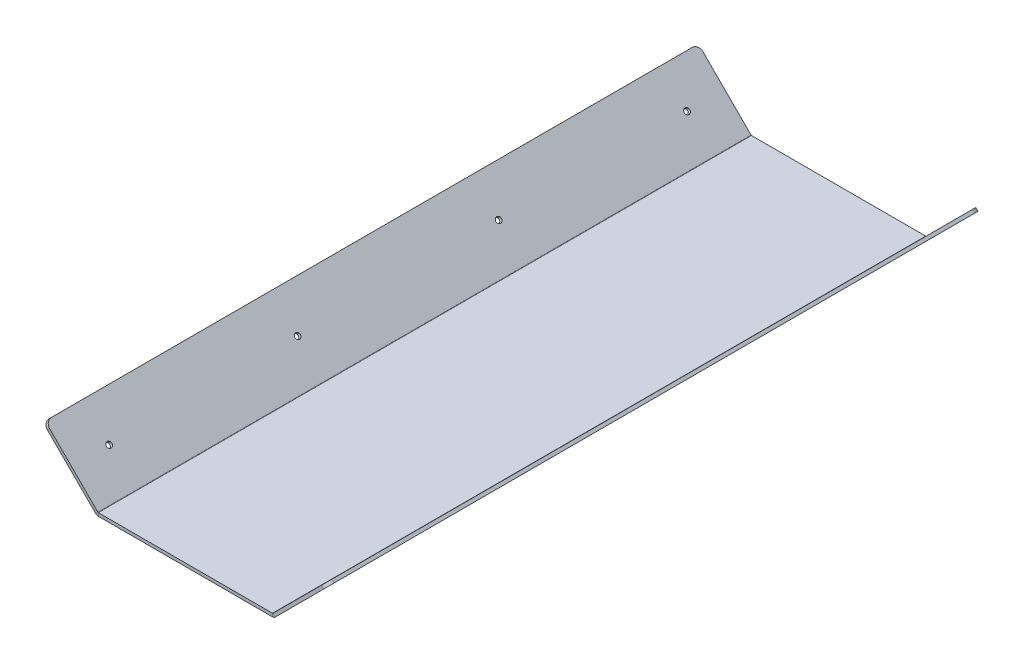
ISO-10303-21;
HEADER;
FILE_DESCRIPTION(('STEP AP214'),'2;1');
FILE_NAME('part.step','',(''),(''),'','','');
FILE_SCHEMA(('AUTOMOTIVE_DESIGN { 1 0 10303 214 1 1 1 1 }'));
ENDSEC;
DATA;
#1=APPLICATION_CONTEXT('core data for automotive mechanical design processes');
#2=APPLICATION_PROTOCOL_DEFINITION('international standard','automotive_design',2000,#1);
#3=PRODUCT_CONTEXT('',#1,'mechanical');
#4=PRODUCT('Part','Part','',(#3));
#5=PRODUCT_RELATED_PRODUCT_CATEGORY('part','',(#4));
#6=PRODUCT_DEFINITION_FORMATION('','',#4);
#7=PRODUCT_DEFINITION_CONTEXT('part definition',#1,'design');
#8=PRODUCT_DEFINITION('design','',#6,#7);
#9=PRODUCT_DEFINITION_SHAPE('','',#8);
#10=(LENGTH_UNIT() NAMED_UNIT(*) SI_UNIT(.MILLI.,.METRE.));
#11=(NAMED_UNIT(*) PLANE_ANGLE_UNIT() SI_UNIT($,.RADIAN.));
#12=(NAMED_UNIT(*) SI_UNIT($,.STERADIAN.) SOLID_ANGLE_UNIT());
#13=UNCERTAINTY_MEASURE_WITH_UNIT(LENGTH_MEASURE(1.E-05),#10,'distance_accuracy_value','');
#14=(GEOMETRIC_REPRESENTATION_CONTEXT(3) GLOBAL_UNCERTAINTY_ASSIGNED_CONTEXT((#13)) GLOBAL_UNIT_ASSIGNED_CONTEXT((#10,
#11,#12)) REPRESENTATION_CONTEXT('',''));
#15=CARTESIAN_POINT('',(0.,0.,0.));
#16=DIRECTION('',(0.,0.,1.));
#17=DIRECTION('',(1.,0.,0.));
#18=AXIS2_PLACEMENT_3D('',#15,#16,#17);
#19=CARTESIAN_POINT('',(-52.0764143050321,125.723585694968,0.));
#20=DIRECTION('',(0.,-1.,0.));
#21=DIRECTION('',(0.,0.,-1.));
#22=AXIS2_PLACEMENT_3D('',#19,#20,#21);
#23=PLANE('',#22);
#24=DIRECTION('',(-1.,0.,0.));
#25=VECTOR('',#24,1.);
#26=CARTESIAN_POINT('',(-52.0764143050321,125.723585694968,-660.4));
#27=LINE('',#26,#25);
#28=CARTESIAN_POINT('',(201.010913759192,125.723585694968,-660.4));
#29=VERTEX_POINT('',#28);
#30=CARTESIAN_POINT('',(25.0362576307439,125.723585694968,-660.4));
#31=VERTEX_POINT('',#30);
#32=EDGE_CURVE('E281',#29,#31,#27,.T.);
#33=ORIENTED_EDGE('',*,*,#32,.F.);
#34=DIRECTION('',(0.,0.,1.));
#35=VECTOR('',#34,1.);
#36=CARTESIAN_POINT('',(201.010913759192,125.723585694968,0.));
#37=LINE('',#36,#35);
#38=CARTESIAN_POINT('',(201.010913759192,125.723585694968,0.));
#39=VERTEX_POINT('',#38);
#40=EDGE_CURVE('E276',#29,#39,#37,.T.);
#41=ORIENTED_EDGE('',*,*,#40,.T.);
#42=DIRECTION('',(1.,0.,0.));
#43=VECTOR('',#42,1.);
#44=CARTESIAN_POINT('',(-52.0764143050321,125.723585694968,0.));
#45=LINE('',#44,#43);
#46=CARTESIAN_POINT('',(25.0362576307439,125.723585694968,0.));
#47=VERTEX_POINT('',#46);
#48=EDGE_CURVE('E237',#47,#39,#45,.T.);
#49=ORIENTED_EDGE('',*,*,#48,.F.);
#50=DIRECTION('',(0.,0.,-1.));
#51=VECTOR('',#50,1.);
#52=CARTESIAN_POINT('',(25.0362576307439,125.723585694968,0.));
#53=LINE('',#52,#51);
#54=EDGE_CURVE('E265',#47,#31,#53,.T.);
#55=ORIENTED_EDGE('',*,*,#54,.T.);
#56=EDGE_LOOP('',(#33,#41,#49,#55));
#57=FACE_BOUND('',#56,.T.);
#58=ADVANCED_FACE('F46',(#57),#23,.T.);
#59=CARTESIAN_POINT('',(-52.0764143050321,128.898585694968,0.));
#60=DIRECTION('',(0.,0.,-1.));
#61=DIRECTION('',(-1.,0.,0.));
#62=AXIS2_PLACEMENT_3D('',#59,#60,#61);
#63=PLANE('',#62);
#64=DIRECTION('',(0.,-1.,0.));
#65=VECTOR('',#64,1.);
#66=CARTESIAN_POINT('',(201.010913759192,128.898585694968,0.));
#67=LINE('',#66,#65);
#68=CARTESIAN_POINT('',(201.010913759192,128.898585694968,0.));
#69=VERTEX_POINT('',#68);
#70=EDGE_CURVE('E273',#69,#39,#67,.T.);
#71=ORIENTED_EDGE('',*,*,#70,.F.);
#72=DIRECTION('',(1.,0.,0.));
#73=VECTOR('',#72,1.);
#74=CARTESIAN_POINT('',(-52.0764143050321,128.898585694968,0.));
#75=LINE('',#74,#73);
#76=CARTESIAN_POINT('',(25.0362576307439,128.898585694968,0.));
#77=VERTEX_POINT('',#76);
#78=EDGE_CURVE('E283',#77,#69,#75,.T.);
#79=ORIENTED_EDGE('',*,*,#78,.F.);
#80=DIRECTION('',(0.,1.,0.));
#81=VECTOR('',#80,1.);
#82=CARTESIAN_POINT('',(25.0362576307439,128.898585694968,0.));
#83=LINE('',#82,#81);
#84=EDGE_CURVE('E268',#47,#77,#83,.T.);
#85=ORIENTED_EDGE('',*,*,#84,.F.);
#86=ORIENTED_EDGE('',*,*,#48,.T.);
#87=EDGE_LOOP('',(#71,#79,#85,#86));
#88=FACE_BOUND('',#87,.T.);
#89=ADVANCED_FACE('F373',(#88),#63,.F.);
#90=CARTESIAN_POINT('',(-52.0764143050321,128.898585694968,-660.4));
#91=DIRECTION('',(0.,0.,1.));
#92=DIRECTION('',(1.,0.,0.));
#93=AXIS2_PLACEMENT_3D('',#90,#91,#92);
#94=PLANE('',#93);
#95=DIRECTION('',(0.,1.,0.));
#96=VECTOR('',#95,1.);
#97=CARTESIAN_POINT('',(201.010913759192,128.898585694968,-660.4));
#98=LINE('',#97,#96);
#99=CARTESIAN_POINT('',(201.010913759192,128.898585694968,-660.4));
#100=VERTEX_POINT('',#99);
#101=EDGE_CURVE('E188',#29,#100,#98,.T.);
#102=ORIENTED_EDGE('',*,*,#101,.F.);
#103=ORIENTED_EDGE('',*,*,#32,.T.);
#104=DIRECTION('',(0.,-1.,0.));
#105=VECTOR('',#104,1.);
#106=CARTESIAN_POINT('',(25.0362576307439,128.898585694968,-660.4));
#107=LINE('',#106,#105);
#108=CARTESIAN_POINT('',(25.0362576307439,128.898585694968,-660.4));
#109=VERTEX_POINT('',#108);
#110=EDGE_CURVE('E261',#109,#31,#107,.T.);
#111=ORIENTED_EDGE('',*,*,#110,.F.);
#112=DIRECTION('',(-1.,0.,0.));
#113=VECTOR('',#112,1.);
#114=CARTESIAN_POINT('',(-52.0764143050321,128.898585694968,-660.4));
#115=LINE('',#114,#113);
#116=EDGE_CURVE('E262',#100,#109,#115,.T.);
#117=ORIENTED_EDGE('',*,*,#116,.F.);
#118=EDGE_LOOP('',(#102,#103,#111,#117));
#119=FACE_BOUND('',#118,.T.);
#120=ADVANCED_FACE('F380',(#119),#94,.F.);
#121=CARTESIAN_POINT('',(-52.0764143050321,128.898585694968,0.));
#122=DIRECTION('',(0.,-1.,0.));
#123=DIRECTION('',(0.,0.,-1.));
#124=AXIS2_PLACEMENT_3D('',#121,#122,#123);
#125=PLANE('',#124);
#126=DIRECTION('',(0.,0.,1.));
#127=VECTOR('',#126,1.);
#128=CARTESIAN_POINT('',(201.010913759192,128.898585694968,0.));
#129=LINE('',#128,#127);
#130=EDGE_CURVE('E271',#100,#69,#129,.T.);
#131=ORIENTED_EDGE('',*,*,#130,.F.);
#132=ORIENTED_EDGE('',*,*,#116,.T.);
#133=DIRECTION('',(0.,0.,-1.));
#134=VECTOR('',#133,1.);
#135=CARTESIAN_POINT('',(25.0362576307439,128.898585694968,0.));
#136=LINE('',#135,#134);
#137=EDGE_CURVE('E258',#77,#109,#136,.T.);
#138=ORIENTED_EDGE('',*,*,#137,.F.);
#139=ORIENTED_EDGE('',*,*,#78,.T.);
#140=EDGE_LOOP('',(#131,#132,#138,#139));
#141=FACE_BOUND('',#140,.T.);
#142=ADVANCED_FACE('F452',(#141),#125,.F.);
#143=CARTESIAN_POINT('',(-28.720777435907,182.350511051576,0.));
#144=DIRECTION('',(0.707106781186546,-0.707106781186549,0.));
#145=DIRECTION('',(0.,0.,-1.));
#146=AXIS2_PLACEMENT_3D('',#143,#144,#145);
#147=PLANE('',#146);
#148=DIRECTION('',(0.,0.,1.));
#149=VECTOR('',#148,1.);
#150=CARTESIAN_POINT('',(-28.720777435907,182.350511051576,0.));
#151=LINE('',#150,#149);
#152=CARTESIAN_POINT('',(-28.7207774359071,182.350511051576,-654.05));
#153=VERTEX_POINT('',#152);
#154=CARTESIAN_POINT('',(-28.720777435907,182.350511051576,-6.35));
#155=VERTEX_POINT('',#154);
#156=EDGE_CURVE('E245',#153,#155,#151,.T.);
#157=ORIENTED_EDGE('',*,*,#156,.F.);
#158=DIRECTION('',(-0.707106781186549,-0.707106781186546,0.));
#159=VECTOR('',#158,1.);
#160=CARTESIAN_POINT('',(-28.7207774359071,182.350511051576,-654.05));
#161=LINE('',#160,#159);
#162=CARTESIAN_POINT('',(-30.9658414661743,180.105447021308,-654.05));
#163=VERTEX_POINT('',#162);
#164=EDGE_CURVE('E332',#153,#163,#161,.T.);
#165=ORIENTED_EDGE('',*,*,#164,.T.);
#166=DIRECTION('',(0.,0.,1.));
#167=VECTOR('',#166,1.);
#168=CARTESIAN_POINT('',(-30.9658414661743,180.105447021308,0.));
#169=LINE('',#168,#167);
#170=CARTESIAN_POINT('',(-30.9658414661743,180.105447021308,-6.35));
#171=VERTEX_POINT('',#170);
#172=EDGE_CURVE('E254',#163,#171,#169,.T.);
#173=ORIENTED_EDGE('',*,*,#172,.T.);
#174=DIRECTION('',(-0.707106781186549,-0.707106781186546,0.));
#175=VECTOR('',#174,1.);
#176=CARTESIAN_POINT('',(-28.720777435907,182.350511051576,-6.35));
#177=LINE('',#176,#175);
#178=EDGE_CURVE('E330',#171,#155,#177,.F.);
#179=ORIENTED_EDGE('',*,*,#178,.T.);
#180=EDGE_LOOP('',(#157,#165,#173,#179));
#181=FACE_BOUND('',#180,.T.);
#182=ADVANCED_FACE('F346',(#181),#147,.F.);
#183=CARTESIAN_POINT('',(-28.720777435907,182.350511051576,0.));
#184=DIRECTION('',(-0.707106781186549,-0.707106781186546,0.));
#185=DIRECTION('',(0.,0.,-1.));
#186=AXIS2_PLACEMENT_3D('',#183,#184,#185);
#187=PLANE('',#186);
#188=CARTESIAN_POINT('',(-2.10268733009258,155.732420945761,-38.1));
#189=DIRECTION('',(0.707106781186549,0.707106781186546,0.));
#190=DIRECTION('',(-0.707106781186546,0.707106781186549,0.));
#191=AXIS2_PLACEMENT_3D('',#188,#189,#190);
#192=CIRCLE('',#191,2.77812500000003);
#193=CARTESIAN_POINT('',(-4.06711835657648,157.696851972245,-38.1));
#194=VERTEX_POINT('',#193);
#195=EDGE_CURVE('E292',#194,#194,#192,.T.);
#196=ORIENTED_EDGE('',*,*,#195,.F.);
#197=EDGE_LOOP('',(#196));
#198=FACE_BOUND('',#197,.T.);
#199=CARTESIAN_POINT('',(-2.10268733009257,155.732420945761,-228.6));
#200=DIRECTION('',(0.707106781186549,0.707106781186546,0.));
#201=DIRECTION('',(-0.707106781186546,0.707106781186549,0.));
#202=AXIS2_PLACEMENT_3D('',#199,#200,#201);
#203=CIRCLE('',#202,2.77812499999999);
#204=CARTESIAN_POINT('',(-4.06711835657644,157.696851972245,-228.6));
#205=VERTEX_POINT('',#204);
#206=EDGE_CURVE('E396',#205,#205,#203,.T.);
#207=ORIENTED_EDGE('',*,*,#206,.F.);
#208=EDGE_LOOP('',(#207));
#209=FACE_BOUND('',#208,.T.);
#210=CARTESIAN_POINT('',(-2.10268733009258,155.732420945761,-431.8));
#211=DIRECTION('',(0.707106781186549,0.707106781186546,0.));
#212=DIRECTION('',(-0.707106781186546,0.707106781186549,0.));
#213=AXIS2_PLACEMENT_3D('',#210,#211,#212);
#214=CIRCLE('',#213,2.77812500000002);
#215=CARTESIAN_POINT('',(-4.06711835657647,157.696851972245,-431.8));
#216=VERTEX_POINT('',#215);
#217=EDGE_CURVE('E393',#216,#216,#214,.T.);
#218=ORIENTED_EDGE('',*,*,#217,.F.);
#219=EDGE_LOOP('',(#218));
#220=FACE_BOUND('',#219,.T.);
#221=CARTESIAN_POINT('',(-2.10268733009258,155.732420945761,-622.3));
#222=DIRECTION('',(0.707106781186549,0.707106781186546,0.));
#223=DIRECTION('',(-0.707106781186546,0.707106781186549,0.));
#224=AXIS2_PLACEMENT_3D('',#221,#222,#223);
#225=CIRCLE('',#224,2.77812499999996);
#226=CARTESIAN_POINT('',(-4.06711835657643,157.696851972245,-622.3));
#227=VERTEX_POINT('',#226);
#228=EDGE_CURVE('E314',#227,#227,#225,.T.);
#229=ORIENTED_EDGE('',*,*,#228,.F.);
#230=EDGE_LOOP('',(#229));
#231=FACE_BOUND('',#230,.T.);
#232=DIRECTION('',(-0.707106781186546,0.707106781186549,0.));
#233=VECTOR('',#232,1.);
#234=CARTESIAN_POINT('',(-28.7207774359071,182.350511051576,-660.4));
#235=LINE('',#234,#233);
#236=CARTESIAN_POINT('',(24.5154027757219,129.114330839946,-660.4));
#237=VERTEX_POINT('',#236);
#238=CARTESIAN_POINT('',(-24.2306493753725,177.860382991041,-660.4));
#239=VERTEX_POINT('',#238);
#240=EDGE_CURVE('E247',#237,#239,#235,.T.);
#241=ORIENTED_EDGE('',*,*,#240,.T.);
#242=CARTESIAN_POINT('',(-24.2306493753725,177.860382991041,-654.05));
#243=DIRECTION('',(-0.707106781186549,-0.707106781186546,0.));
#244=DIRECTION('',(0.707106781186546,-0.707106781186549,0.));
#245=AXIS2_PLACEMENT_3D('',#242,#243,#244);
#246=CIRCLE('',#245,6.35);
#247=EDGE_CURVE('E54',#239,#153,#246,.F.);
#248=ORIENTED_EDGE('',*,*,#247,.T.);
#249=ORIENTED_EDGE('',*,*,#156,.T.);
#250=CARTESIAN_POINT('',(-24.2306493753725,177.860382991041,-6.35));
#251=DIRECTION('',(-0.707106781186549,-0.707106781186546,0.));
#252=DIRECTION('',(0.707106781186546,-0.707106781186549,0.));
#253=AXIS2_PLACEMENT_3D('',#250,#251,#252);
#254=CIRCLE('',#253,6.35);
#255=CARTESIAN_POINT('',(-24.2306493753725,177.860382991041,0.));
#256=VERTEX_POINT('',#255);
#257=EDGE_CURVE('E61',#155,#256,#254,.F.);
#258=ORIENTED_EDGE('',*,*,#257,.T.);
#259=DIRECTION('',(0.707106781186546,-0.707106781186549,0.));
#260=VECTOR('',#259,1.);
#261=CARTESIAN_POINT('',(-28.720777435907,182.350511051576,0.));
#262=LINE('',#261,#260);
#263=CARTESIAN_POINT('',(24.5154027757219,129.114330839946,0.));
#264=VERTEX_POINT('',#263);
#265=EDGE_CURVE('E252',#256,#264,#262,.T.);
#266=ORIENTED_EDGE('',*,*,#265,.T.);
#267=DIRECTION('',(0.,0.,-1.));
#268=VECTOR('',#267,1.);
#269=CARTESIAN_POINT('',(24.5154027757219,129.114330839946,0.));
#270=LINE('',#269,#268);
#271=EDGE_CURVE('E249',#264,#237,#270,.T.);
#272=ORIENTED_EDGE('',*,*,#271,.T.);
#273=EDGE_LOOP('',(#241,#248,#249,#258,#266,#272));
#274=FACE_BOUND('',#273,.T.);
#275=ADVANCED_FACE('F342',(#198,#209,#220,#231,#274),#187,.F.);
#276=CARTESIAN_POINT('',(-28.7207774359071,182.350511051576,-660.4));
#277=DIRECTION('',(0.,0.,1.));
#278=DIRECTION('',(0.707106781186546,-0.707106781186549,0.));
#279=AXIS2_PLACEMENT_3D('',#276,#277,#278);
#280=PLANE('',#279);
#281=DIRECTION('',(-0.707106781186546,0.707106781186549,0.));
#282=VECTOR('',#281,1.);
#283=CARTESIAN_POINT('',(-30.9658414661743,180.105447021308,-660.4));
#284=LINE('',#283,#282);
#285=CARTESIAN_POINT('',(22.2703387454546,126.869266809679,-660.4));
#286=VERTEX_POINT('',#285);
#287=CARTESIAN_POINT('',(-26.4757134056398,175.615318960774,-660.4));
#288=VERTEX_POINT('',#287);
#289=EDGE_CURVE('E240',#286,#288,#284,.T.);
#290=ORIENTED_EDGE('',*,*,#289,.T.);
#291=DIRECTION('',(-0.707106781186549,-0.707106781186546,0.));
#292=VECTOR('',#291,1.);
#293=CARTESIAN_POINT('',(-24.2306493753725,177.860382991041,-660.4));
#294=LINE('',#293,#292);
#295=EDGE_CURVE('E69',#288,#239,#294,.F.);
#296=ORIENTED_EDGE('',*,*,#295,.T.);
#297=ORIENTED_EDGE('',*,*,#240,.F.);
#298=DIRECTION('',(-0.707106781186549,-0.707106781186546,0.));
#299=VECTOR('',#298,1.);
#300=CARTESIAN_POINT('',(24.5154027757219,129.114330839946,-660.4));
#301=LINE('',#300,#299);
#302=EDGE_CURVE('E242',#237,#286,#301,.T.);
#303=ORIENTED_EDGE('',*,*,#302,.T.);
#304=EDGE_LOOP('',(#290,#296,#297,#303));
#305=FACE_BOUND('',#304,.T.);
#306=ADVANCED_FACE('F354',(#305),#280,.F.);
#307=CARTESIAN_POINT('',(-30.9658414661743,180.105447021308,0.));
#308=DIRECTION('',(-0.707106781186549,-0.707106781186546,0.));
#309=DIRECTION('',(0.,0.,-1.));
#310=AXIS2_PLACEMENT_3D('',#307,#308,#309);
#311=PLANE('',#310);
#312=CARTESIAN_POINT('',(-4.34775136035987,153.487356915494,-38.1));
#313=DIRECTION('',(-0.707106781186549,-0.707106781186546,0.));
#314=DIRECTION('',(0.707106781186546,-0.707106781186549,0.));
#315=AXIS2_PLACEMENT_3D('',#312,#313,#314);
#316=CIRCLE('',#315,2.77812500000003);
#317=CARTESIAN_POINT('',(-2.38332033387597,151.52292588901,-38.1));
#318=VERTEX_POINT('',#317);
#319=EDGE_CURVE('E298',#318,#318,#316,.T.);
#320=ORIENTED_EDGE('',*,*,#319,.F.);
#321=EDGE_LOOP('',(#320));
#322=FACE_BOUND('',#321,.T.);
#323=CARTESIAN_POINT('',(-4.34775136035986,153.487356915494,-228.6));
#324=DIRECTION('',(-0.707106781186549,-0.707106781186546,0.));
#325=DIRECTION('',(0.707106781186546,-0.707106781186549,0.));
#326=AXIS2_PLACEMENT_3D('',#323,#324,#325);
#327=CIRCLE('',#326,2.77812499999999);
#328=CARTESIAN_POINT('',(-2.383320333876,151.52292588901,-228.6));
#329=VERTEX_POINT('',#328);
#330=EDGE_CURVE('E295',#329,#329,#327,.T.);
#331=ORIENTED_EDGE('',*,*,#330,.F.);
#332=EDGE_LOOP('',(#331));
#333=FACE_BOUND('',#332,.T.);
#334=CARTESIAN_POINT('',(-4.34775136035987,153.487356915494,-431.8));
#335=DIRECTION('',(-0.707106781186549,-0.707106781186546,0.));
#336=DIRECTION('',(0.707106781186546,-0.707106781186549,0.));
#337=AXIS2_PLACEMENT_3D('',#334,#335,#336);
#338=CIRCLE('',#337,2.77812500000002);
#339=CARTESIAN_POINT('',(-2.38332033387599,151.52292588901,-431.8));
#340=VERTEX_POINT('',#339);
#341=EDGE_CURVE('E291',#340,#340,#338,.T.);
#342=ORIENTED_EDGE('',*,*,#341,.F.);
#343=EDGE_LOOP('',(#342));
#344=FACE_BOUND('',#343,.T.);
#345=CARTESIAN_POINT('',(-4.34775136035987,153.487356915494,-622.3));
#346=DIRECTION('',(-0.707106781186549,-0.707106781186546,0.));
#347=DIRECTION('',(0.707106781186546,-0.707106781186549,0.));
#348=AXIS2_PLACEMENT_3D('',#345,#346,#347);
#349=CIRCLE('',#348,2.77812499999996);
#350=CARTESIAN_POINT('',(-2.38332033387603,151.52292588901,-622.3));
#351=VERTEX_POINT('',#350);
#352=EDGE_CURVE('E288',#351,#351,#349,.T.);
#353=ORIENTED_EDGE('',*,*,#352,.F.);
#354=EDGE_LOOP('',(#353));
#355=FACE_BOUND('',#354,.T.);
#356=ORIENTED_EDGE('',*,*,#172,.F.);
#357=CARTESIAN_POINT('',(-26.4757134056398,175.615318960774,-654.05));
#358=DIRECTION('',(-0.707106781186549,-0.707106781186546,0.));
#359=DIRECTION('',(0.707106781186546,-0.707106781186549,0.));
#360=AXIS2_PLACEMENT_3D('',#357,#358,#359);
#361=CIRCLE('',#360,6.35);
#362=EDGE_CURVE('E337',#163,#288,#361,.T.);
#363=ORIENTED_EDGE('',*,*,#362,.T.);
#364=ORIENTED_EDGE('',*,*,#289,.F.);
#365=DIRECTION('',(0.,0.,-1.));
#366=VECTOR('',#365,1.);
#367=CARTESIAN_POINT('',(22.2703387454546,126.869266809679,0.));
#368=LINE('',#367,#366);
#369=CARTESIAN_POINT('',(22.2703387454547,126.869266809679,0.));
#370=VERTEX_POINT('',#369);
#371=EDGE_CURVE('E231',#370,#286,#368,.T.);
#372=ORIENTED_EDGE('',*,*,#371,.F.);
#373=DIRECTION('',(0.707106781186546,-0.707106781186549,0.));
#374=VECTOR('',#373,1.);
#375=CARTESIAN_POINT('',(-30.9658414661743,180.105447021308,0.));
#376=LINE('',#375,#374);
#377=CARTESIAN_POINT('',(-26.4757134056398,175.615318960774,0.));
#378=VERTEX_POINT('',#377);
#379=EDGE_CURVE('E238',#378,#370,#376,.T.);
#380=ORIENTED_EDGE('',*,*,#379,.F.);
#381=CARTESIAN_POINT('',(-26.4757134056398,175.615318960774,-6.35));
#382=DIRECTION('',(-0.707106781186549,-0.707106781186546,0.));
#383=DIRECTION('',(0.707106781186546,-0.707106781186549,0.));
#384=AXIS2_PLACEMENT_3D('',#381,#382,#383);
#385=CIRCLE('',#384,6.35);
#386=EDGE_CURVE('E335',#378,#171,#385,.T.);
#387=ORIENTED_EDGE('',*,*,#386,.T.);
#388=EDGE_LOOP('',(#356,#363,#364,#372,#380,#387));
#389=FACE_BOUND('',#388,.T.);
#390=ADVANCED_FACE('F352',(#322,#333,#344,#355,#389),#311,.T.);
#391=CARTESIAN_POINT('',(-28.720777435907,182.350511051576,0.));
#392=DIRECTION('',(0.,0.,-1.));
#393=DIRECTION('',(-0.707106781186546,0.707106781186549,0.));
#394=AXIS2_PLACEMENT_3D('',#391,#392,#393);
#395=PLANE('',#394);
#396=ORIENTED_EDGE('',*,*,#265,.F.);
#397=DIRECTION('',(-0.707106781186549,-0.707106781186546,0.));
#398=VECTOR('',#397,1.);
#399=CARTESIAN_POINT('',(-24.2306493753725,177.860382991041,0.));
#400=LINE('',#399,#398);
#401=EDGE_CURVE('E12',#256,#378,#400,.T.);
#402=ORIENTED_EDGE('',*,*,#401,.T.);
#403=ORIENTED_EDGE('',*,*,#379,.T.);
#404=DIRECTION('',(0.707106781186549,0.707106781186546,0.));
#405=VECTOR('',#404,1.);
#406=CARTESIAN_POINT('',(24.5154027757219,129.114330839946,0.));
#407=LINE('',#406,#405);
#408=EDGE_CURVE('E234',#370,#264,#407,.T.);
#409=ORIENTED_EDGE('',*,*,#408,.T.);
#410=EDGE_LOOP('',(#396,#402,#403,#409));
#411=FACE_BOUND('',#410,.T.);
#412=ADVANCED_FACE('F468',(#411),#395,.F.);
#413=CARTESIAN_POINT('',(25.0362576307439,129.635185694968,0.));
#414=DIRECTION('',(0.,0.,-1.));
#415=DIRECTION('',(-0.707106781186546,0.707106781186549,0.));
#416=AXIS2_PLACEMENT_3D('',#413,#414,#415);
#417=PLANE('',#416);
#418=ORIENTED_EDGE('',*,*,#408,.F.);
#419=CARTESIAN_POINT('',(25.0362576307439,129.635185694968,0.));
#420=DIRECTION('',(0.,0.,-1.));
#421=DIRECTION('',(-0.707106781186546,0.707106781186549,0.));
#422=AXIS2_PLACEMENT_3D('',#419,#420,#421);
#423=CIRCLE('',#422,3.9116);
#424=EDGE_CURVE('E202',#370,#47,#423,.F.);
#425=ORIENTED_EDGE('',*,*,#424,.T.);
#426=ORIENTED_EDGE('',*,*,#84,.T.);
#427=CARTESIAN_POINT('',(25.0362576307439,129.635185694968,0.));
#428=DIRECTION('',(0.,0.,1.));
#429=DIRECTION('',(0.707106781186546,-0.707106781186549,0.));
#430=AXIS2_PLACEMENT_3D('',#427,#428,#429);
#431=CIRCLE('',#430,0.736599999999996);
#432=EDGE_CURVE('E225',#264,#77,#431,.T.);
#433=ORIENTED_EDGE('',*,*,#432,.F.);
#434=EDGE_LOOP('',(#418,#425,#426,#433));
#435=FACE_BOUND('',#434,.T.);
#436=ADVANCED_FACE('F367',(#435),#417,.F.);
#437=CARTESIAN_POINT('',(25.0362576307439,129.635185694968,-660.4));
#438=DIRECTION('',(0.,0.,1.));
#439=DIRECTION('',(0.707106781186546,-0.707106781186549,0.));
#440=AXIS2_PLACEMENT_3D('',#437,#438,#439);
#441=PLANE('',#440);
#442=ORIENTED_EDGE('',*,*,#110,.T.);
#443=CARTESIAN_POINT('',(25.0362576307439,129.635185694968,-660.4));
#444=DIRECTION('',(0.,0.,-1.));
#445=DIRECTION('',(-0.707106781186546,0.707106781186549,0.));
#446=AXIS2_PLACEMENT_3D('',#443,#444,#445);
#447=CIRCLE('',#446,3.9116);
#448=EDGE_CURVE('E205',#31,#286,#447,.T.);
#449=ORIENTED_EDGE('',*,*,#448,.T.);
#450=ORIENTED_EDGE('',*,*,#302,.F.);
#451=CARTESIAN_POINT('',(25.0362576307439,129.635185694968,-660.4));
#452=DIRECTION('',(0.,0.,-1.));
#453=DIRECTION('',(-0.707106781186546,0.707106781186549,0.));
#454=AXIS2_PLACEMENT_3D('',#451,#452,#453);
#455=CIRCLE('',#454,0.7366);
#456=EDGE_CURVE('E228',#109,#237,#455,.T.);
#457=ORIENTED_EDGE('',*,*,#456,.F.);
#458=EDGE_LOOP('',(#442,#449,#450,#457));
#459=FACE_BOUND('',#458,.T.);
#460=ADVANCED_FACE('F357',(#459),#441,.F.);
#461=CARTESIAN_POINT('',(25.0362576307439,129.635185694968,330.210154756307));
#462=DIRECTION('',(0.,0.,-1.));
#463=DIRECTION('',(-0.707106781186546,0.707106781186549,0.));
#464=AXIS2_PLACEMENT_3D('',#461,#462,#463);
#465=CYLINDRICAL_SURFACE('',#464,0.7366);
#466=ORIENTED_EDGE('',*,*,#456,.T.);
#467=ORIENTED_EDGE('',*,*,#271,.F.);
#468=ORIENTED_EDGE('',*,*,#432,.T.);
#469=ORIENTED_EDGE('',*,*,#137,.T.);
#470=EDGE_LOOP('',(#466,#467,#468,#469));
#471=FACE_BOUND('',#470,.T.);
#472=ADVANCED_FACE('F361',(#471),#465,.F.);
#473=CARTESIAN_POINT('',(25.0362576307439,129.635185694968,330.210154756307));
#474=DIRECTION('',(0.,0.,-1.));
#475=DIRECTION('',(-0.707106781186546,0.707106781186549,0.));
#476=AXIS2_PLACEMENT_3D('',#473,#474,#475);
#477=CYLINDRICAL_SURFACE('',#476,3.9116);
#478=ORIENTED_EDGE('',*,*,#448,.F.);
#479=ORIENTED_EDGE('',*,*,#54,.F.);
#480=ORIENTED_EDGE('',*,*,#424,.F.);
#481=ORIENTED_EDGE('',*,*,#371,.T.);
#482=EDGE_LOOP('',(#478,#479,#480,#481));
#483=FACE_BOUND('',#482,.T.);
#484=ADVANCED_FACE('F375',(#483),#477,.T.);
#485=CARTESIAN_POINT('',(254.767948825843,182.350511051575,0.));
#486=DIRECTION('',(-0.707106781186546,-0.707106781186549,0.));
#487=DIRECTION('',(0.,0.,1.));
#488=AXIS2_PLACEMENT_3D('',#485,#486,#487);
#489=PLANE('',#488);
#490=DIRECTION('',(0.,0.,-1.));
#491=VECTOR('',#490,1.);
#492=CARTESIAN_POINT('',(254.767948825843,182.350511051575,0.));
#493=LINE('',#492,#491);
#494=CARTESIAN_POINT('',(254.767948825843,182.350511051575,-6.35));
#495=VERTEX_POINT('',#494);
#496=CARTESIAN_POINT('',(254.767948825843,182.350511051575,-654.05));
#497=VERTEX_POINT('',#496);
#498=EDGE_CURVE('E218',#495,#497,#493,.T.);
#499=ORIENTED_EDGE('',*,*,#498,.F.);
#500=DIRECTION('',(0.707106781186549,-0.707106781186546,0.));
#501=VECTOR('',#500,1.);
#502=CARTESIAN_POINT('',(254.767948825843,182.350511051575,-6.35));
#503=LINE('',#502,#501);
#504=CARTESIAN_POINT('',(257.01301285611,180.105447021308,-6.35));
#505=VERTEX_POINT('',#504);
#506=EDGE_CURVE('E316',#495,#505,#503,.T.);
#507=ORIENTED_EDGE('',*,*,#506,.T.);
#508=DIRECTION('',(0.,0.,-1.));
#509=VECTOR('',#508,1.);
#510=CARTESIAN_POINT('',(257.01301285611,180.105447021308,0.));
#511=LINE('',#510,#509);
#512=CARTESIAN_POINT('',(257.01301285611,180.105447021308,-654.05));
#513=VERTEX_POINT('',#512);
#514=EDGE_CURVE('E176',#505,#513,#511,.T.);
#515=ORIENTED_EDGE('',*,*,#514,.T.);
#516=DIRECTION('',(0.707106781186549,-0.707106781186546,0.));
#517=VECTOR('',#516,1.);
#518=CARTESIAN_POINT('',(254.767948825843,182.350511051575,-654.05));
#519=LINE('',#518,#517);
#520=EDGE_CURVE('E280',#513,#497,#519,.F.);
#521=ORIENTED_EDGE('',*,*,#520,.T.);
#522=EDGE_LOOP('',(#499,#507,#515,#521));
#523=FACE_BOUND('',#522,.T.);
#524=ADVANCED_FACE('F418',(#523),#489,.F.);
#525=CARTESIAN_POINT('',(21.2812896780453,-51.1361480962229,0.));
#526=DIRECTION('',(0.707106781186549,-0.707106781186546,0.));
#527=DIRECTION('',(0.,0.,-1.));
#528=AXIS2_PLACEMENT_3D('',#525,#526,#527);
#529=PLANE('',#528);
#530=CARTESIAN_POINT('',(228.149858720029,155.732420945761,-622.3));
#531=DIRECTION('',(-0.707106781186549,0.707106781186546,0.));
#532=DIRECTION('',(-0.707106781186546,-0.707106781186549,0.));
#533=AXIS2_PLACEMENT_3D('',#530,#531,#532);
#534=CIRCLE('',#533,2.77812499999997);
#535=CARTESIAN_POINT('',(226.185427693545,153.767989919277,-622.3));
#536=VERTEX_POINT('',#535);
#537=EDGE_CURVE('E305',#536,#536,#534,.T.);
#538=ORIENTED_EDGE('',*,*,#537,.F.);
#539=EDGE_LOOP('',(#538));
#540=FACE_BOUND('',#539,.T.);
#541=CARTESIAN_POINT('',(228.149858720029,155.732420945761,-506.658398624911));
#542=DIRECTION('',(-0.707106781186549,0.707106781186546,0.));
#543=DIRECTION('',(-0.707106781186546,-0.707106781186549,0.));
#544=AXIS2_PLACEMENT_3D('',#541,#542,#543);
#545=CIRCLE('',#544,2.77812499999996);
#546=CARTESIAN_POINT('',(226.185427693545,153.767989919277,-506.658398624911));
#547=VERTEX_POINT('',#546);
#548=EDGE_CURVE('E407',#547,#547,#545,.T.);
#549=ORIENTED_EDGE('',*,*,#548,.F.);
#550=EDGE_LOOP('',(#549));
#551=FACE_BOUND('',#550,.T.);
#552=CARTESIAN_POINT('',(228.149858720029,155.732420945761,-228.6));
#553=DIRECTION('',(-0.707106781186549,0.707106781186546,0.));
#554=DIRECTION('',(-0.707106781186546,-0.707106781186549,0.));
#555=AXIS2_PLACEMENT_3D('',#552,#553,#554);
#556=CIRCLE('',#555,2.778125);
#557=CARTESIAN_POINT('',(226.185427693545,153.767989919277,-228.6));
#558=VERTEX_POINT('',#557);
#559=EDGE_CURVE('E404',#558,#558,#556,.T.);
#560=ORIENTED_EDGE('',*,*,#559,.F.);
#561=EDGE_LOOP('',(#560));
#562=FACE_BOUND('',#561,.T.);
#563=CARTESIAN_POINT('',(228.149858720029,155.732420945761,-38.1));
#564=DIRECTION('',(-0.707106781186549,0.707106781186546,0.));
#565=DIRECTION('',(-0.707106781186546,-0.707106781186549,0.));
#566=AXIS2_PLACEMENT_3D('',#563,#564,#565);
#567=CIRCLE('',#566,2.77812500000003);
#568=CARTESIAN_POINT('',(226.185427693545,153.767989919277,-38.1));
#569=VERTEX_POINT('',#568);
#570=EDGE_CURVE('E401',#569,#569,#567,.T.);
#571=ORIENTED_EDGE('',*,*,#570,.F.);
#572=EDGE_LOOP('',(#571));
#573=FACE_BOUND('',#572,.T.);
#574=DIRECTION('',(0.707106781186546,0.707106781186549,0.));
#575=VECTOR('',#574,1.);
#576=CARTESIAN_POINT('',(21.2812896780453,-51.1361480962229,0.));
#577=LINE('',#576,#575);
#578=CARTESIAN_POINT('',(201.531768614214,129.114330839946,0.));
#579=VERTEX_POINT('',#578);
#580=CARTESIAN_POINT('',(250.277820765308,177.860382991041,0.));
#581=VERTEX_POINT('',#580);
#582=EDGE_CURVE('E197',#579,#581,#577,.T.);
#583=ORIENTED_EDGE('',*,*,#582,.T.);
#584=CARTESIAN_POINT('',(250.277820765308,177.860382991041,-6.35));
#585=DIRECTION('',(0.707106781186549,-0.707106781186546,0.));
#586=DIRECTION('',(0.707106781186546,0.707106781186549,0.));
#587=AXIS2_PLACEMENT_3D('',#584,#585,#586);
#588=CIRCLE('',#587,6.35);
#589=EDGE_CURVE('E326',#581,#495,#588,.F.);
#590=ORIENTED_EDGE('',*,*,#589,.T.);
#591=ORIENTED_EDGE('',*,*,#498,.T.);
#592=CARTESIAN_POINT('',(250.277820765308,177.860382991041,-654.05));
#593=DIRECTION('',(0.707106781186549,-0.707106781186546,0.));
#594=DIRECTION('',(0.707106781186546,0.707106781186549,0.));
#595=AXIS2_PLACEMENT_3D('',#592,#593,#594);
#596=CIRCLE('',#595,6.35);
#597=CARTESIAN_POINT('',(250.277820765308,177.860382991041,-660.4));
#598=VERTEX_POINT('',#597);
#599=EDGE_CURVE('E171',#497,#598,#596,.F.);
#600=ORIENTED_EDGE('',*,*,#599,.T.);
#601=DIRECTION('',(-0.707106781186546,-0.707106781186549,0.));
#602=VECTOR('',#601,1.);
#603=CARTESIAN_POINT('',(21.2812896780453,-51.1361480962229,-660.4));
#604=LINE('',#603,#602);
#605=CARTESIAN_POINT('',(201.531768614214,129.114330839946,-660.4));
#606=VERTEX_POINT('',#605);
#607=EDGE_CURVE('E162',#598,#606,#604,.T.);
#608=ORIENTED_EDGE('',*,*,#607,.T.);
#609=DIRECTION('',(0.,0.,1.));
#610=VECTOR('',#609,1.);
#611=CARTESIAN_POINT('',(201.531768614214,129.114330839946,0.));
#612=LINE('',#611,#610);
#613=EDGE_CURVE('E167',#606,#579,#612,.T.);
#614=ORIENTED_EDGE('',*,*,#613,.T.);
#615=EDGE_LOOP('',(#583,#590,#591,#600,#608,#614));
#616=FACE_BOUND('',#615,.T.);
#617=ADVANCED_FACE('F165',(#540,#551,#562,#573,#616),#529,.F.);
#618=CARTESIAN_POINT('',(21.2812896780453,-51.1361480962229,0.));
#619=DIRECTION('',(0.,0.,-1.));
#620=DIRECTION('',(-0.707106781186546,-0.707106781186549,0.));
#621=AXIS2_PLACEMENT_3D('',#618,#619,#620);
#622=PLANE('',#621);
#623=DIRECTION('',(0.707106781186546,0.707106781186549,0.));
#624=VECTOR('',#623,1.);
#625=CARTESIAN_POINT('',(23.5263537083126,-53.3812121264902,0.));
#626=LINE('',#625,#624);
#627=CARTESIAN_POINT('',(203.776832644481,126.869266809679,0.));
#628=VERTEX_POINT('',#627);
#629=CARTESIAN_POINT('',(252.522884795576,175.615318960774,0.));
#630=VERTEX_POINT('',#629);
#631=EDGE_CURVE('E207',#628,#630,#626,.T.);
#632=ORIENTED_EDGE('',*,*,#631,.T.);
#633=DIRECTION('',(0.707106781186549,-0.707106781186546,0.));
#634=VECTOR('',#633,1.);
#635=CARTESIAN_POINT('',(250.277820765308,177.860382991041,0.));
#636=LINE('',#635,#634);
#637=EDGE_CURVE('E323',#630,#581,#636,.F.);
#638=ORIENTED_EDGE('',*,*,#637,.T.);
#639=ORIENTED_EDGE('',*,*,#582,.F.);
#640=DIRECTION('',(0.707106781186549,-0.707106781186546,0.));
#641=VECTOR('',#640,1.);
#642=CARTESIAN_POINT('',(201.531768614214,129.114330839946,0.));
#643=LINE('',#642,#641);
#644=EDGE_CURVE('E215',#579,#628,#643,.T.);
#645=ORIENTED_EDGE('',*,*,#644,.T.);
#646=EDGE_LOOP('',(#632,#638,#639,#645));
#647=FACE_BOUND('',#646,.T.);
#648=ADVANCED_FACE('F417',(#647),#622,.F.);
#649=CARTESIAN_POINT('',(23.5263537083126,-53.3812121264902,0.));
#650=DIRECTION('',(0.707106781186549,-0.707106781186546,0.));
#651=DIRECTION('',(0.,0.,-1.));
#652=AXIS2_PLACEMENT_3D('',#649,#650,#651);
#653=PLANE('',#652);
#654=CARTESIAN_POINT('',(230.394922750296,153.487356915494,-622.3));
#655=DIRECTION('',(0.707106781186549,-0.707106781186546,0.));
#656=DIRECTION('',(0.707106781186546,0.707106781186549,0.));
#657=AXIS2_PLACEMENT_3D('',#654,#655,#656);
#658=CIRCLE('',#657,2.77812499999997);
#659=CARTESIAN_POINT('',(232.35935377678,155.451787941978,-622.3));
#660=VERTEX_POINT('',#659);
#661=EDGE_CURVE('E311',#660,#660,#658,.T.);
#662=ORIENTED_EDGE('',*,*,#661,.F.);
#663=EDGE_LOOP('',(#662));
#664=FACE_BOUND('',#663,.T.);
#665=CARTESIAN_POINT('',(230.394922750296,153.487356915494,-506.658398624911));
#666=DIRECTION('',(0.707106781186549,-0.707106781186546,0.));
#667=DIRECTION('',(0.707106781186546,0.707106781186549,0.));
#668=AXIS2_PLACEMENT_3D('',#665,#666,#667);
#669=CIRCLE('',#668,2.77812499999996);
#670=CARTESIAN_POINT('',(232.35935377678,155.451787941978,-506.658398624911));
#671=VERTEX_POINT('',#670);
#672=EDGE_CURVE('E308',#671,#671,#669,.T.);
#673=ORIENTED_EDGE('',*,*,#672,.F.);
#674=EDGE_LOOP('',(#673));
#675=FACE_BOUND('',#674,.T.);
#676=CARTESIAN_POINT('',(230.394922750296,153.487356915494,-228.6));
#677=DIRECTION('',(0.707106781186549,-0.707106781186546,0.));
#678=DIRECTION('',(0.707106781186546,0.707106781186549,0.));
#679=AXIS2_PLACEMENT_3D('',#676,#677,#678);
#680=CIRCLE('',#679,2.778125);
#681=CARTESIAN_POINT('',(232.35935377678,155.451787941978,-228.6));
#682=VERTEX_POINT('',#681);
#683=EDGE_CURVE('E304',#682,#682,#680,.T.);
#684=ORIENTED_EDGE('',*,*,#683,.F.);
#685=EDGE_LOOP('',(#684));
#686=FACE_BOUND('',#685,.T.);
#687=CARTESIAN_POINT('',(230.394922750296,153.487356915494,-38.1));
#688=DIRECTION('',(0.707106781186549,-0.707106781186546,0.));
#689=DIRECTION('',(0.707106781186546,0.707106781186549,0.));
#690=AXIS2_PLACEMENT_3D('',#687,#688,#689);
#691=CIRCLE('',#690,2.77812500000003);
#692=CARTESIAN_POINT('',(232.35935377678,155.451787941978,-38.1));
#693=VERTEX_POINT('',#692);
#694=EDGE_CURVE('E301',#693,#693,#691,.T.);
#695=ORIENTED_EDGE('',*,*,#694,.F.);
#696=EDGE_LOOP('',(#695));
#697=FACE_BOUND('',#696,.T.);
#698=ORIENTED_EDGE('',*,*,#514,.F.);
#699=CARTESIAN_POINT('',(252.522884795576,175.615318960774,-6.35));
#700=DIRECTION('',(0.707106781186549,-0.707106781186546,0.));
#701=DIRECTION('',(0.707106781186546,0.707106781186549,0.));
#702=AXIS2_PLACEMENT_3D('',#699,#700,#701);
#703=CIRCLE('',#702,6.35);
#704=EDGE_CURVE('E321',#505,#630,#703,.T.);
#705=ORIENTED_EDGE('',*,*,#704,.T.);
#706=ORIENTED_EDGE('',*,*,#631,.F.);
#707=DIRECTION('',(0.,0.,1.));
#708=VECTOR('',#707,1.);
#709=CARTESIAN_POINT('',(203.776832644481,126.869266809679,0.));
#710=LINE('',#709,#708);
#711=CARTESIAN_POINT('',(203.776832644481,126.869266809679,-660.4));
#712=VERTEX_POINT('',#711);
#713=EDGE_CURVE('E223',#712,#628,#710,.T.);
#714=ORIENTED_EDGE('',*,*,#713,.F.);
#715=DIRECTION('',(-0.707106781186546,-0.707106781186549,0.));
#716=VECTOR('',#715,1.);
#717=CARTESIAN_POINT('',(23.5263537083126,-53.3812121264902,-660.4));
#718=LINE('',#717,#716);
#719=CARTESIAN_POINT('',(252.522884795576,175.615318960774,-660.4));
#720=VERTEX_POINT('',#719);
#721=EDGE_CURVE('E201',#720,#712,#718,.T.);
#722=ORIENTED_EDGE('',*,*,#721,.F.);
#723=CARTESIAN_POINT('',(252.522884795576,175.615318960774,-654.05));
#724=DIRECTION('',(0.707106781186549,-0.707106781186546,0.));
#725=DIRECTION('',(0.707106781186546,0.707106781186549,0.));
#726=AXIS2_PLACEMENT_3D('',#723,#724,#725);
#727=CIRCLE('',#726,6.35);
#728=EDGE_CURVE('E319',#720,#513,#727,.T.);
#729=ORIENTED_EDGE('',*,*,#728,.T.);
#730=EDGE_LOOP('',(#698,#705,#706,#714,#722,#729));
#731=FACE_BOUND('',#730,.T.);
#732=ADVANCED_FACE('F497',(#664,#675,#686,#697,#731),#653,.T.);
#733=CARTESIAN_POINT('',(21.2812896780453,-51.1361480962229,-660.4));
#734=DIRECTION('',(0.,0.,1.));
#735=DIRECTION('',(0.707106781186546,0.707106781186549,0.));
#736=AXIS2_PLACEMENT_3D('',#733,#734,#735);
#737=PLANE('',#736);
#738=ORIENTED_EDGE('',*,*,#607,.F.);
#739=DIRECTION('',(0.707106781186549,-0.707106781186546,0.));
#740=VECTOR('',#739,1.);
#741=CARTESIAN_POINT('',(250.277820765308,177.860382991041,-660.4));
#742=LINE('',#741,#740);
#743=EDGE_CURVE('E328',#598,#720,#742,.T.);
#744=ORIENTED_EDGE('',*,*,#743,.T.);
#745=ORIENTED_EDGE('',*,*,#721,.T.);
#746=DIRECTION('',(-0.707106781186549,0.707106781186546,0.));
#747=VECTOR('',#746,1.);
#748=CARTESIAN_POINT('',(201.531768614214,129.114330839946,-660.4));
#749=LINE('',#748,#747);
#750=EDGE_CURVE('E185',#712,#606,#749,.T.);
#751=ORIENTED_EDGE('',*,*,#750,.T.);
#752=EDGE_LOOP('',(#738,#744,#745,#751));
#753=FACE_BOUND('',#752,.T.);
#754=ADVANCED_FACE('F199',(#753),#737,.F.);
#755=CARTESIAN_POINT('',(201.010913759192,129.635185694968,-660.4));
#756=DIRECTION('',(0.,0.,1.));
#757=DIRECTION('',(1.,0.,0.));
#758=AXIS2_PLACEMENT_3D('',#755,#756,#757);
#759=PLANE('',#758);
#760=ORIENTED_EDGE('',*,*,#750,.F.);
#761=CARTESIAN_POINT('',(201.010913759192,129.635185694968,-660.4));
#762=DIRECTION('',(0.,0.,1.));
#763=DIRECTION('',(1.,0.,0.));
#764=AXIS2_PLACEMENT_3D('',#761,#762,#763);
#765=CIRCLE('',#764,3.9116);
#766=EDGE_CURVE('E210',#712,#29,#765,.F.);
#767=ORIENTED_EDGE('',*,*,#766,.T.);
#768=ORIENTED_EDGE('',*,*,#101,.T.);
#769=CARTESIAN_POINT('',(201.010913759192,129.635185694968,-660.4));
#770=DIRECTION('',(0.,0.,-1.));
#771=DIRECTION('',(-1.,0.,0.));
#772=AXIS2_PLACEMENT_3D('',#769,#770,#771);
#773=CIRCLE('',#772,0.736599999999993);
#774=EDGE_CURVE('E182',#606,#100,#773,.T.);
#775=ORIENTED_EDGE('',*,*,#774,.F.);
#776=EDGE_LOOP('',(#760,#767,#768,#775));
#777=FACE_BOUND('',#776,.T.);
#778=ADVANCED_FACE('F183',(#777),#759,.F.);
#779=CARTESIAN_POINT('',(201.010913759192,129.635185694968,0.));
#780=DIRECTION('',(0.,0.,-1.));
#781=DIRECTION('',(0.,1.,0.));
#782=AXIS2_PLACEMENT_3D('',#779,#780,#781);
#783=PLANE('',#782);
#784=ORIENTED_EDGE('',*,*,#70,.T.);
#785=CARTESIAN_POINT('',(201.010913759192,129.635185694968,0.));
#786=DIRECTION('',(0.,0.,1.));
#787=DIRECTION('',(1.,0.,0.));
#788=AXIS2_PLACEMENT_3D('',#785,#786,#787);
#789=CIRCLE('',#788,3.9116);
#790=EDGE_CURVE('E192',#39,#628,#789,.T.);
#791=ORIENTED_EDGE('',*,*,#790,.T.);
#792=ORIENTED_EDGE('',*,*,#644,.F.);
#793=CARTESIAN_POINT('',(201.010913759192,129.635185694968,0.));
#794=DIRECTION('',(0.,0.,1.));
#795=DIRECTION('',(0.,-1.,0.));
#796=AXIS2_PLACEMENT_3D('',#793,#794,#795);
#797=CIRCLE('',#796,0.736600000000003);
#798=EDGE_CURVE('E191',#69,#579,#797,.T.);
#799=ORIENTED_EDGE('',*,*,#798,.F.);
#800=EDGE_LOOP('',(#784,#791,#792,#799));
#801=FACE_BOUND('',#800,.T.);
#802=ADVANCED_FACE('F487',(#801),#783,.F.);
#803=CARTESIAN_POINT('',(201.010913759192,129.635185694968,-990.618930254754));
#804=DIRECTION('',(0.,0.,1.));
#805=DIRECTION('',(1.,0.,0.));
#806=AXIS2_PLACEMENT_3D('',#803,#804,#805);
#807=CYLINDRICAL_SURFACE('',#806,0.7366);
#808=ORIENTED_EDGE('',*,*,#798,.T.);
#809=ORIENTED_EDGE('',*,*,#613,.F.);
#810=ORIENTED_EDGE('',*,*,#774,.T.);
#811=ORIENTED_EDGE('',*,*,#130,.T.);
#812=EDGE_LOOP('',(#808,#809,#810,#811));
#813=FACE_BOUND('',#812,.T.);
#814=ADVANCED_FACE('F195',(#813),#807,.F.);
#815=CARTESIAN_POINT('',(201.010913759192,129.635185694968,-990.618930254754));
#816=DIRECTION('',(0.,0.,1.));
#817=DIRECTION('',(1.,0.,0.));
#818=AXIS2_PLACEMENT_3D('',#815,#816,#817);
#819=CYLINDRICAL_SURFACE('',#818,3.9116);
#820=ORIENTED_EDGE('',*,*,#790,.F.);
#821=ORIENTED_EDGE('',*,*,#40,.F.);
#822=ORIENTED_EDGE('',*,*,#766,.F.);
#823=ORIENTED_EDGE('',*,*,#713,.T.);
#824=EDGE_LOOP('',(#820,#821,#822,#823));
#825=FACE_BOUND('',#824,.T.);
#826=ADVANCED_FACE('F384',(#825),#819,.T.);
#827=CARTESIAN_POINT('',(-31.5386820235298,126.296426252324,-622.3));
#828=DIRECTION('',(0.707106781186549,0.707106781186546,0.));
#829=DIRECTION('',(-0.707106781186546,0.707106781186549,0.));
#830=AXIS2_PLACEMENT_3D('',#827,#828,#829);
#831=CYLINDRICAL_SURFACE('',#830,2.77812499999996);
#832=ORIENTED_EDGE('',*,*,#352,.T.);
#833=EDGE_LOOP('',(#832));
#834=FACE_BOUND('',#833,.T.);
#835=ORIENTED_EDGE('',*,*,#228,.T.);
#836=EDGE_LOOP('',(#835));
#837=FACE_BOUND('',#836,.T.);
#838=ADVANCED_FACE('F610',(#834,#837),#831,.F.);
#839=CARTESIAN_POINT('',(-31.5386820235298,126.296426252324,-431.8));
#840=DIRECTION('',(0.707106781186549,0.707106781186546,0.));
#841=DIRECTION('',(-0.707106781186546,0.707106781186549,0.));
#842=AXIS2_PLACEMENT_3D('',#839,#840,#841);
#843=CYLINDRICAL_SURFACE('',#842,2.77812500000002);
#844=ORIENTED_EDGE('',*,*,#341,.T.);
#845=EDGE_LOOP('',(#844));
#846=FACE_BOUND('',#845,.T.);
#847=ORIENTED_EDGE('',*,*,#217,.T.);
#848=EDGE_LOOP('',(#847));
#849=FACE_BOUND('',#848,.T.);
#850=ADVANCED_FACE('F617',(#846,#849),#843,.F.);
#851=CARTESIAN_POINT('',(-31.5386820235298,126.296426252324,-228.6));
#852=DIRECTION('',(0.707106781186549,0.707106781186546,0.));
#853=DIRECTION('',(-0.707106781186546,0.707106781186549,0.));
#854=AXIS2_PLACEMENT_3D('',#851,#852,#853);
#855=CYLINDRICAL_SURFACE('',#854,2.77812499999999);
#856=ORIENTED_EDGE('',*,*,#330,.T.);
#857=EDGE_LOOP('',(#856));
#858=FACE_BOUND('',#857,.T.);
#859=ORIENTED_EDGE('',*,*,#206,.T.);
#860=EDGE_LOOP('',(#859));
#861=FACE_BOUND('',#860,.T.);
#862=ADVANCED_FACE('F439',(#858,#861),#855,.F.);
#863=CARTESIAN_POINT('',(-31.5386820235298,126.296426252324,-38.1));
#864=DIRECTION('',(0.707106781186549,0.707106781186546,0.));
#865=DIRECTION('',(-0.707106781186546,0.707106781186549,0.));
#866=AXIS2_PLACEMENT_3D('',#863,#864,#865);
#867=CYLINDRICAL_SURFACE('',#866,2.77812500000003);
#868=ORIENTED_EDGE('',*,*,#319,.T.);
#869=EDGE_LOOP('',(#868));
#870=FACE_BOUND('',#869,.T.);
#871=ORIENTED_EDGE('',*,*,#195,.T.);
#872=EDGE_LOOP('',(#871));
#873=FACE_BOUND('',#872,.T.);
#874=ADVANCED_FACE('F429',(#870,#873),#867,.F.);
#875=CARTESIAN_POINT('',(257.585853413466,126.296426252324,-38.1));
#876=DIRECTION('',(-0.707106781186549,0.707106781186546,0.));
#877=DIRECTION('',(-0.707106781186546,-0.707106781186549,0.));
#878=AXIS2_PLACEMENT_3D('',#875,#876,#877);
#879=CYLINDRICAL_SURFACE('',#878,2.77812500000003);
#880=ORIENTED_EDGE('',*,*,#694,.T.);
#881=EDGE_LOOP('',(#880));
#882=FACE_BOUND('',#881,.T.);
#883=ORIENTED_EDGE('',*,*,#570,.T.);
#884=EDGE_LOOP('',(#883));
#885=FACE_BOUND('',#884,.T.);
#886=ADVANCED_FACE('F426',(#882,#885),#879,.F.);
#887=CARTESIAN_POINT('',(257.585853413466,126.296426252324,-228.6));
#888=DIRECTION('',(-0.707106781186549,0.707106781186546,0.));
#889=DIRECTION('',(-0.707106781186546,-0.707106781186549,0.));
#890=AXIS2_PLACEMENT_3D('',#887,#888,#889);
#891=CYLINDRICAL_SURFACE('',#890,2.778125);
#892=ORIENTED_EDGE('',*,*,#683,.T.);
#893=EDGE_LOOP('',(#892));
#894=FACE_BOUND('',#893,.T.);
#895=ORIENTED_EDGE('',*,*,#559,.T.);
#896=EDGE_LOOP('',(#895));
#897=FACE_BOUND('',#896,.T.);
#898=ADVANCED_FACE('F428',(#894,#897),#891,.F.);
#899=CARTESIAN_POINT('',(257.585853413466,126.296426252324,-506.658398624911));
#900=DIRECTION('',(-0.707106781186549,0.707106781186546,0.));
#901=DIRECTION('',(-0.707106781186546,-0.707106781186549,0.));
#902=AXIS2_PLACEMENT_3D('',#899,#900,#901);
#903=CYLINDRICAL_SURFACE('',#902,2.77812499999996);
#904=ORIENTED_EDGE('',*,*,#672,.T.);
#905=EDGE_LOOP('',(#904));
#906=FACE_BOUND('',#905,.T.);
#907=ORIENTED_EDGE('',*,*,#548,.T.);
#908=EDGE_LOOP('',(#907));
#909=FACE_BOUND('',#908,.T.);
#910=ADVANCED_FACE('F436',(#906,#909),#903,.F.);
#911=CARTESIAN_POINT('',(257.585853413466,126.296426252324,-622.3));
#912=DIRECTION('',(-0.707106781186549,0.707106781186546,0.));
#913=DIRECTION('',(-0.707106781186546,-0.707106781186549,0.));
#914=AXIS2_PLACEMENT_3D('',#911,#912,#913);
#915=CYLINDRICAL_SURFACE('',#914,2.77812499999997);
#916=ORIENTED_EDGE('',*,*,#661,.T.);
#917=EDGE_LOOP('',(#916));
#918=FACE_BOUND('',#917,.T.);
#919=ORIENTED_EDGE('',*,*,#537,.T.);
#920=EDGE_LOOP('',(#919));
#921=FACE_BOUND('',#920,.T.);
#922=ADVANCED_FACE('F413',(#918,#921),#915,.F.);
#923=CARTESIAN_POINT('',(250.277820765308,177.860382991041,-6.35));
#924=DIRECTION('',(0.707106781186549,-0.707106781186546,0.));
#925=DIRECTION('',(0.707106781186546,0.707106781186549,0.));
#926=AXIS2_PLACEMENT_3D('',#923,#924,#925);
#927=CYLINDRICAL_SURFACE('',#926,6.35);
#928=ORIENTED_EDGE('',*,*,#589,.F.);
#929=ORIENTED_EDGE('',*,*,#637,.F.);
#930=ORIENTED_EDGE('',*,*,#704,.F.);
#931=ORIENTED_EDGE('',*,*,#506,.F.);
#932=EDGE_LOOP('',(#928,#929,#930,#931));
#933=FACE_BOUND('',#932,.T.);
#934=ADVANCED_FACE('F453',(#933),#927,.T.);
#935=CARTESIAN_POINT('',(250.277820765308,177.860382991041,-654.05));
#936=DIRECTION('',(0.707106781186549,-0.707106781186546,0.));
#937=DIRECTION('',(0.707106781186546,0.707106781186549,0.));
#938=AXIS2_PLACEMENT_3D('',#935,#936,#937);
#939=CYLINDRICAL_SURFACE('',#938,6.35);
#940=ORIENTED_EDGE('',*,*,#599,.F.);
#941=ORIENTED_EDGE('',*,*,#520,.F.);
#942=ORIENTED_EDGE('',*,*,#728,.F.);
#943=ORIENTED_EDGE('',*,*,#743,.F.);
#944=EDGE_LOOP('',(#940,#941,#942,#943));
#945=FACE_BOUND('',#944,.T.);
#946=ADVANCED_FACE('F456',(#945),#939,.T.);
#947=CARTESIAN_POINT('',(-24.2306493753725,177.860382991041,-654.05));
#948=DIRECTION('',(-0.707106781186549,-0.707106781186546,0.));
#949=DIRECTION('',(0.707106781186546,-0.707106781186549,0.));
#950=AXIS2_PLACEMENT_3D('',#947,#948,#949);
#951=CYLINDRICAL_SURFACE('',#950,6.35);
#952=ORIENTED_EDGE('',*,*,#247,.F.);
#953=ORIENTED_EDGE('',*,*,#295,.F.);
#954=ORIENTED_EDGE('',*,*,#362,.F.);
#955=ORIENTED_EDGE('',*,*,#164,.F.);
#956=EDGE_LOOP('',(#952,#953,#954,#955));
#957=FACE_BOUND('',#956,.T.);
#958=ADVANCED_FACE('F349',(#957),#951,.T.);
#959=CARTESIAN_POINT('',(-24.2306493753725,177.860382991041,-6.35));
#960=DIRECTION('',(-0.707106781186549,-0.707106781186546,0.));
#961=DIRECTION('',(0.707106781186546,-0.707106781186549,0.));
#962=AXIS2_PLACEMENT_3D('',#959,#960,#961);
#963=CYLINDRICAL_SURFACE('',#962,6.35);
#964=ORIENTED_EDGE('',*,*,#257,.F.);
#965=ORIENTED_EDGE('',*,*,#178,.F.);
#966=ORIENTED_EDGE('',*,*,#386,.F.);
#967=ORIENTED_EDGE('',*,*,#401,.F.);
#968=EDGE_LOOP('',(#964,#965,#966,#967));
#969=FACE_BOUND('',#968,.T.);
#970=ADVANCED_FACE('F48',(#969),#963,.T.);
#971=CLOSED_SHELL('',(#58,#89,#120,#142,#182,#275,#306,#390,#412,#436,#460,#472,#484,#524,#617,
#648,#732,#754,#778,#802,#814,#826,#838,#850,#862,#874,#886,#898,#910,#922,#934,#946,#958,#970));
#972=MANIFOLD_SOLID_BREP('B2',#971);
#973=ADVANCED_BREP_SHAPE_REPRESENTATION('',(#18,#972),#14);
#974=SHAPE_DEFINITION_REPRESENTATION(#9,#973);
ENDSEC;
END-ISO-10303-21;
